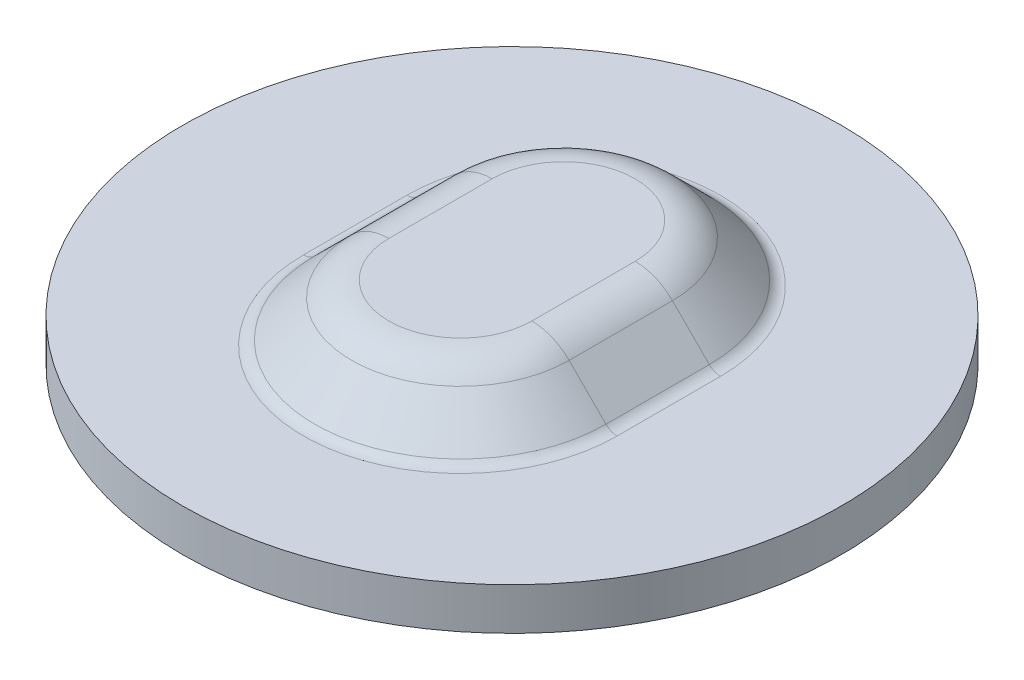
ISO-10303-21;
HEADER;
FILE_DESCRIPTION(('STEP AP214'),'2;1');
FILE_NAME('part.step','',(''),(''),'','','');
FILE_SCHEMA(('AUTOMOTIVE_DESIGN { 1 0 10303 214 1 1 1 1 }'));
ENDSEC;
DATA;
#1=APPLICATION_CONTEXT('core data for automotive mechanical design processes');
#2=APPLICATION_PROTOCOL_DEFINITION('international standard','automotive_design',2000,#1);
#3=PRODUCT_CONTEXT('',#1,'mechanical');
#4=PRODUCT('Part','Part','',(#3));
#5=PRODUCT_RELATED_PRODUCT_CATEGORY('part','',(#4));
#6=PRODUCT_DEFINITION_FORMATION('','',#4);
#7=PRODUCT_DEFINITION_CONTEXT('part definition',#1,'design');
#8=PRODUCT_DEFINITION('design','',#6,#7);
#9=PRODUCT_DEFINITION_SHAPE('','',#8);
#10=(LENGTH_UNIT() NAMED_UNIT(*) SI_UNIT(.MILLI.,.METRE.));
#11=(NAMED_UNIT(*) PLANE_ANGLE_UNIT() SI_UNIT($,.RADIAN.));
#12=(NAMED_UNIT(*) SI_UNIT($,.STERADIAN.) SOLID_ANGLE_UNIT());
#13=UNCERTAINTY_MEASURE_WITH_UNIT(LENGTH_MEASURE(1.E-05),#10,'distance_accuracy_value','');
#14=(GEOMETRIC_REPRESENTATION_CONTEXT(3) GLOBAL_UNCERTAINTY_ASSIGNED_CONTEXT((#13)) GLOBAL_UNIT_ASSIGNED_CONTEXT((#10,
#11,#12)) REPRESENTATION_CONTEXT('',''));
#15=CARTESIAN_POINT('',(0.,0.,0.));
#16=DIRECTION('',(0.,0.,1.));
#17=DIRECTION('',(1.,0.,0.));
#18=AXIS2_PLACEMENT_3D('',#15,#16,#17);
#19=CARTESIAN_POINT('',(0.472109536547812,0.,-1.65075517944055));
#20=DIRECTION('',(0.,-1.,0.));
#21=DIRECTION('',(0.,0.,-1.));
#22=AXIS2_PLACEMENT_3D('',#19,#20,#21);
#23=PLANE('',#22);
#24=DIRECTION('',(0.,0.,1.));
#25=VECTOR('',#24,1.);
#26=CARTESIAN_POINT('',(3.91580708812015,0.,-1.65075517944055));
#27=LINE('',#26,#25);
#28=CARTESIAN_POINT('',(3.91580708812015,0.,-1.65075517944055));
#29=VERTEX_POINT('',#28);
#30=CARTESIAN_POINT('',(3.91580708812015,0.,3.32764482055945));
#31=VERTEX_POINT('',#30);
#32=EDGE_CURVE('E156',#29,#31,#27,.T.);
#33=ORIENTED_EDGE('',*,*,#32,.F.);
#34=CARTESIAN_POINT('',(0.472109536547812,0.,-1.65075517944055));
#35=DIRECTION('',(0.,-1.,0.));
#36=DIRECTION('',(0.,0.,-1.));
#37=AXIS2_PLACEMENT_3D('',#34,#35,#36);
#38=CIRCLE('',#37,3.44369755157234);
#39=CARTESIAN_POINT('',(0.472109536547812,0.,-5.09445273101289));
#40=VERTEX_POINT('',#39);
#41=EDGE_CURVE('E143',#40,#29,#38,.T.);
#42=ORIENTED_EDGE('',*,*,#41,.F.);
#43=CARTESIAN_POINT('',(0.472109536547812,0.,-1.65075517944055));
#44=DIRECTION('',(0.,-1.,0.));
#45=DIRECTION('',(-1.,0.,0.));
#46=AXIS2_PLACEMENT_3D('',#43,#44,#45);
#47=CIRCLE('',#46,3.44369755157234);
#48=CARTESIAN_POINT('',(-2.97158801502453,0.,-1.65075517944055));
#49=VERTEX_POINT('',#48);
#50=EDGE_CURVE('E150',#49,#40,#47,.T.);
#51=ORIENTED_EDGE('',*,*,#50,.F.);
#52=DIRECTION('',(0.,0.,-1.));
#53=VECTOR('',#52,1.);
#54=CARTESIAN_POINT('',(-2.97158801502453,0.,-1.65075517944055));
#55=LINE('',#54,#53);
#56=CARTESIAN_POINT('',(-2.97158801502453,0.,3.32764482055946));
#57=VERTEX_POINT('',#56);
#58=EDGE_CURVE('E205',#57,#49,#55,.T.);
#59=ORIENTED_EDGE('',*,*,#58,.F.);
#60=CARTESIAN_POINT('',(0.472109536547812,0.,3.32764482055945));
#61=DIRECTION('',(0.,-1.,0.));
#62=DIRECTION('',(1.,0.,0.));
#63=AXIS2_PLACEMENT_3D('',#60,#61,#62);
#64=CIRCLE('',#63,3.44369755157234);
#65=EDGE_CURVE('E158',#31,#57,#64,.T.);
#66=ORIENTED_EDGE('',*,*,#65,.F.);
#67=EDGE_LOOP('',(#33,#42,#51,#59,#66));
#68=FACE_BOUND('',#67,.T.);
#69=ADVANCED_FACE('F18',(#68),#23,.F.);
#70=CARTESIAN_POINT('',(0.472109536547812,-2.54,-1.65075517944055));
#71=DIRECTION('',(0.,-1.,0.));
#72=DIRECTION('',(0.,0.,-1.));
#73=AXIS2_PLACEMENT_3D('',#70,#71,#72);
#74=TOROIDAL_SURFACE('',#73,3.44369755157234,2.54);
#75=CARTESIAN_POINT('',(0.472109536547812,-0.743948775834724,-1.65075517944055));
#76=DIRECTION('',(0.,-1.,0.));
#77=DIRECTION('',(0.,0.,-1.));
#78=AXIS2_PLACEMENT_3D('',#75,#76,#77);
#79=CIRCLE('',#78,5.23974877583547);
#80=CARTESIAN_POINT('',(-4.76763923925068,-0.743948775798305,-1.65075517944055));
#81=VERTEX_POINT('',#80);
#82=CARTESIAN_POINT('',(5.71185831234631,-0.743948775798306,-1.65075517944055));
#83=VERTEX_POINT('',#82);
#84=EDGE_CURVE('E163',#81,#83,#79,.T.);
#85=ORIENTED_EDGE('',*,*,#84,.F.);
#86=CARTESIAN_POINT('',(-2.97158801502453,-2.54,-1.65075517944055));
#87=DIRECTION('',(0.,0.,-1.));
#88=DIRECTION('',(-1.,0.,0.));
#89=AXIS2_PLACEMENT_3D('',#86,#87,#88);
#90=CIRCLE('',#89,2.54);
#91=EDGE_CURVE('E214',#49,#81,#90,.F.);
#92=ORIENTED_EDGE('',*,*,#91,.F.);
#93=ORIENTED_EDGE('',*,*,#50,.T.);
#94=ORIENTED_EDGE('',*,*,#41,.T.);
#95=CARTESIAN_POINT('',(3.91580708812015,-2.54,-1.65075517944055));
#96=DIRECTION('',(0.,0.,1.));
#97=DIRECTION('',(1.,0.,0.));
#98=AXIS2_PLACEMENT_3D('',#95,#96,#97);
#99=CIRCLE('',#98,2.54);
#100=EDGE_CURVE('E147',#83,#29,#99,.T.);
#101=ORIENTED_EDGE('',*,*,#100,.F.);
#102=EDGE_LOOP('',(#85,#92,#93,#94,#101));
#103=FACE_BOUND('',#102,.T.);
#104=ADVANCED_FACE('F145',(#103),#74,.T.);
#105=CARTESIAN_POINT('',(-2.97158801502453,-2.54,-1.65075517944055));
#106=DIRECTION('',(0.,0.,-1.));
#107=DIRECTION('',(-1.,0.,0.));
#108=AXIS2_PLACEMENT_3D('',#105,#106,#107);
#109=CYLINDRICAL_SURFACE('',#108,2.54);
#110=CARTESIAN_POINT('',(-2.97158801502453,-2.54,3.32764482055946));
#111=DIRECTION('',(0.,0.,-1.));
#112=DIRECTION('',(-1.,0.,0.));
#113=AXIS2_PLACEMENT_3D('',#110,#111,#112);
#114=CIRCLE('',#113,2.54);
#115=CARTESIAN_POINT('',(-4.7676392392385,-0.743948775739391,3.32764482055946));
#116=VERTEX_POINT('',#115);
#117=EDGE_CURVE('E213',#57,#116,#114,.F.);
#118=ORIENTED_EDGE('',*,*,#117,.F.);
#119=ORIENTED_EDGE('',*,*,#58,.T.);
#120=ORIENTED_EDGE('',*,*,#91,.T.);
#121=DIRECTION('',(0.,0.,1.));
#122=VECTOR('',#121,1.);
#123=CARTESIAN_POINT('',(-4.76763923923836,-0.743948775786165,3.32764482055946));
#124=LINE('',#123,#122);
#125=EDGE_CURVE('E188',#116,#81,#124,.F.);
#126=ORIENTED_EDGE('',*,*,#125,.F.);
#127=EDGE_LOOP('',(#118,#119,#120,#126));
#128=FACE_BOUND('',#127,.T.);
#129=ADVANCED_FACE('F196',(#128),#109,.T.);
#130=CARTESIAN_POINT('',(0.472109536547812,-2.54,3.32764482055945));
#131=DIRECTION('',(0.,-1.,0.));
#132=DIRECTION('',(0.,0.,-1.));
#133=AXIS2_PLACEMENT_3D('',#130,#131,#132);
#134=TOROIDAL_SURFACE('',#133,3.44369755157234,2.54);
#135=CARTESIAN_POINT('',(3.91580708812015,-2.54,3.32764482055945));
#136=DIRECTION('',(0.,0.,1.));
#137=DIRECTION('',(1.,0.,0.));
#138=AXIS2_PLACEMENT_3D('',#135,#136,#137);
#139=CIRCLE('',#138,2.54);
#140=CARTESIAN_POINT('',(5.71185831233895,-0.743948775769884,3.32764482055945));
#141=VERTEX_POINT('',#140);
#142=EDGE_CURVE('E169',#31,#141,#139,.F.);
#143=ORIENTED_EDGE('',*,*,#142,.F.);
#144=ORIENTED_EDGE('',*,*,#65,.T.);
#145=ORIENTED_EDGE('',*,*,#117,.T.);
#146=CARTESIAN_POINT('',(0.472109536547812,-0.743948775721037,3.32764482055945));
#147=DIRECTION('',(0.,-1.,0.));
#148=DIRECTION('',(0.,0.,1.));
#149=AXIS2_PLACEMENT_3D('',#146,#147,#148);
#150=CIRCLE('',#149,5.23974877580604);
#151=EDGE_CURVE('E178',#141,#116,#150,.T.);
#152=ORIENTED_EDGE('',*,*,#151,.F.);
#153=EDGE_LOOP('',(#143,#144,#145,#152));
#154=FACE_BOUND('',#153,.T.);
#155=ADVANCED_FACE('F191',(#154),#134,.T.);
#156=CARTESIAN_POINT('',(3.91580708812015,-2.54,-1.65075517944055));
#157=DIRECTION('',(0.,0.,1.));
#158=DIRECTION('',(1.,0.,0.));
#159=AXIS2_PLACEMENT_3D('',#156,#157,#158);
#160=CYLINDRICAL_SURFACE('',#159,2.54);
#161=ORIENTED_EDGE('',*,*,#100,.T.);
#162=ORIENTED_EDGE('',*,*,#32,.T.);
#163=ORIENTED_EDGE('',*,*,#142,.T.);
#164=DIRECTION('',(0.,0.,1.));
#165=VECTOR('',#164,1.);
#166=CARTESIAN_POINT('',(5.71185831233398,-0.743948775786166,3.32764482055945));
#167=LINE('',#166,#165);
#168=EDGE_CURVE('E167',#83,#141,#167,.T.);
#169=ORIENTED_EDGE('',*,*,#168,.F.);
#170=EDGE_LOOP('',(#161,#162,#163,#169));
#171=FACE_BOUND('',#170,.T.);
#172=ADVANCED_FACE('F165',(#171),#160,.T.);
#173=CARTESIAN_POINT('',(0.472109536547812,-2.032,-1.65075517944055));
#174=DIRECTION('',(0.,-1.,0.));
#175=DIRECTION('',(0.,0.,-1.));
#176=AXIS2_PLACEMENT_3D('',#173,#174,#175);
#177=PLANE('',#176);
#178=CARTESIAN_POINT('',(0.472109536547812,-2.032,-1.65075517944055));
#179=DIRECTION('',(0.,1.,0.));
#180=DIRECTION('',(1.,0.,0.));
#181=AXIS2_PLACEMENT_3D('',#178,#179,#180);
#182=CIRCLE('',#181,3.44369755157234);
#183=CARTESIAN_POINT('',(0.472109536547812,-2.032,-5.09445273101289));
#184=VERTEX_POINT('',#183);
#185=CARTESIAN_POINT('',(3.91580708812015,-2.032,-1.65075517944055));
#186=VERTEX_POINT('',#185);
#187=EDGE_CURVE('E312',#184,#186,#182,.F.);
#188=ORIENTED_EDGE('',*,*,#187,.T.);
#189=DIRECTION('',(0.,0.,1.));
#190=VECTOR('',#189,1.);
#191=CARTESIAN_POINT('',(3.91580708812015,-2.032,-1.65075517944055));
#192=LINE('',#191,#190);
#193=CARTESIAN_POINT('',(3.91580708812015,-2.032,3.32764482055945));
#194=VERTEX_POINT('',#193);
#195=EDGE_CURVE('E277',#186,#194,#192,.T.);
#196=ORIENTED_EDGE('',*,*,#195,.T.);
#197=CARTESIAN_POINT('',(0.472109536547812,-2.032,3.32764482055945));
#198=DIRECTION('',(0.,1.,0.));
#199=DIRECTION('',(-1.,0.,0.));
#200=AXIS2_PLACEMENT_3D('',#197,#198,#199);
#201=CIRCLE('',#200,3.44369755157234);
#202=CARTESIAN_POINT('',(-2.97158801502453,-2.032,3.32764482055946));
#203=VERTEX_POINT('',#202);
#204=EDGE_CURVE('E360',#194,#203,#201,.F.);
#205=ORIENTED_EDGE('',*,*,#204,.T.);
#206=DIRECTION('',(0.,0.,-1.));
#207=VECTOR('',#206,1.);
#208=CARTESIAN_POINT('',(-2.97158801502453,-2.032,-1.65075517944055));
#209=LINE('',#208,#207);
#210=CARTESIAN_POINT('',(-2.97158801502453,-2.032,-1.65075517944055));
#211=VERTEX_POINT('',#210);
#212=EDGE_CURVE('E351',#203,#211,#209,.T.);
#213=ORIENTED_EDGE('',*,*,#212,.T.);
#214=CARTESIAN_POINT('',(0.472109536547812,-2.032,-1.65075517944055));
#215=DIRECTION('',(0.,1.,0.));
#216=DIRECTION('',(0.,0.,-1.));
#217=AXIS2_PLACEMENT_3D('',#214,#215,#216);
#218=CIRCLE('',#217,3.44369755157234);
#219=EDGE_CURVE('E354',#211,#184,#218,.F.);
#220=ORIENTED_EDGE('',*,*,#219,.T.);
#221=EDGE_LOOP('',(#188,#196,#205,#213,#220));
#222=FACE_BOUND('',#221,.T.);
#223=ADVANCED_FACE('F366',(#222),#177,.T.);
#224=CARTESIAN_POINT('',(0.472109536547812,-2.52001536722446,-1.65075517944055));
#225=DIRECTION('',(0.,-1.,0.));
#226=DIRECTION('',(0.,0.,-1.));
#227=AXIS2_PLACEMENT_3D('',#224,#225,#226);
#228=CONICAL_SURFACE('',#227,7.01581536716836,0.785398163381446);
#229=CARTESIAN_POINT('',(0.472109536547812,-2.52001536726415,-1.65075517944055));
#230=DIRECTION('',(0.,-1.,0.));
#231=DIRECTION('',(0.,0.,-1.));
#232=AXIS2_PLACEMENT_3D('',#229,#230,#231);
#233=CIRCLE('',#232,7.01581536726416);
#234=CARTESIAN_POINT('',(7.48792490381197,-2.52001536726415,-1.65075517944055));
#235=VERTEX_POINT('',#234);
#236=CARTESIAN_POINT('',(-6.54370583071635,-2.52001536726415,-1.65075517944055));
#237=VERTEX_POINT('',#236);
#238=EDGE_CURVE('E335',#235,#237,#233,.F.);
#239=ORIENTED_EDGE('',*,*,#238,.T.);
#240=DIRECTION('',(-0.707106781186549,-0.707106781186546,0.));
#241=VECTOR('',#240,1.);
#242=CARTESIAN_POINT('',(-4.02369046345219,0.,-1.65075517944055));
#243=LINE('',#242,#241);
#244=EDGE_CURVE('E346',#81,#237,#243,.T.);
#245=ORIENTED_EDGE('',*,*,#244,.F.);
#246=ORIENTED_EDGE('',*,*,#84,.T.);
#247=DIRECTION('',(-0.707106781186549,0.707106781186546,0.));
#248=VECTOR('',#247,1.);
#249=CARTESIAN_POINT('',(4.96790953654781,0.,-1.65075517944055));
#250=LINE('',#249,#248);
#251=EDGE_CURVE('E276',#235,#83,#250,.T.);
#252=ORIENTED_EDGE('',*,*,#251,.F.);
#253=EDGE_LOOP('',(#239,#245,#246,#252));
#254=FACE_BOUND('',#253,.T.);
#255=ADVANCED_FACE('F375',(#254),#228,.T.);
#256=CARTESIAN_POINT('',(-4.02369046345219,0.,3.32764482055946));
#257=DIRECTION('',(-0.707106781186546,0.707106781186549,0.));
#258=DIRECTION('',(-0.707106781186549,-0.707106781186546,0.));
#259=AXIS2_PLACEMENT_3D('',#256,#257,#258);
#260=PLANE('',#259);
#261=DIRECTION('',(0.707106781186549,0.707106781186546,0.));
#262=VECTOR('',#261,1.);
#263=CARTESIAN_POINT('',(-498996.200245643,-498992.176555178,3.32764482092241));
#264=LINE('',#263,#262);
#265=CARTESIAN_POINT('',(-6.54370583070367,-2.52001536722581,3.32764482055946));
#266=VERTEX_POINT('',#265);
#267=EDGE_CURVE('E181',#116,#266,#264,.F.);
#268=ORIENTED_EDGE('',*,*,#267,.F.);
#269=ORIENTED_EDGE('',*,*,#125,.T.);
#270=ORIENTED_EDGE('',*,*,#244,.T.);
#271=DIRECTION('',(0.,0.,1.));
#272=VECTOR('',#271,1.);
#273=CARTESIAN_POINT('',(-6.54370583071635,-2.52001536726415,3.32764482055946));
#274=LINE('',#273,#272);
#275=EDGE_CURVE('E332',#237,#266,#274,.T.);
#276=ORIENTED_EDGE('',*,*,#275,.T.);
#277=EDGE_LOOP('',(#268,#269,#270,#276));
#278=FACE_BOUND('',#277,.T.);
#279=ADVANCED_FACE('F876',(#278),#260,.T.);
#280=CARTESIAN_POINT('',(0.472109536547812,-2.52001536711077,3.32764482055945));
#281=DIRECTION('',(0.,-1.,0.));
#282=DIRECTION('',(0.,0.,-1.));
#283=AXIS2_PLACEMENT_3D('',#280,#281,#282);
#284=CONICAL_SURFACE('',#283,7.01581536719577,0.785398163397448);
#285=CARTESIAN_POINT('',(0.472109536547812,-2.52001536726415,3.32764482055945));
#286=DIRECTION('',(0.,-1.,0.));
#287=DIRECTION('',(0.,0.,-1.));
#288=AXIS2_PLACEMENT_3D('',#285,#286,#287);
#289=CIRCLE('',#288,7.01581536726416);
#290=CARTESIAN_POINT('',(7.48792490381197,-2.52001536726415,3.32764482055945));
#291=VERTEX_POINT('',#290);
#292=EDGE_CURVE('E326',#266,#291,#289,.F.);
#293=ORIENTED_EDGE('',*,*,#292,.T.);
#294=DIRECTION('',(-0.707106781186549,0.707106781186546,0.));
#295=VECTOR('',#294,1.);
#296=CARTESIAN_POINT('',(4.96790953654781,0.,3.32764482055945));
#297=LINE('',#296,#295);
#298=EDGE_CURVE('E180',#141,#291,#297,.F.);
#299=ORIENTED_EDGE('',*,*,#298,.F.);
#300=ORIENTED_EDGE('',*,*,#151,.T.);
#301=ORIENTED_EDGE('',*,*,#267,.T.);
#302=EDGE_LOOP('',(#293,#299,#300,#301));
#303=FACE_BOUND('',#302,.T.);
#304=ADVANCED_FACE('F869',(#303),#284,.T.);
#305=CARTESIAN_POINT('',(4.96790953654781,0.,3.32764482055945));
#306=DIRECTION('',(0.707106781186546,0.707106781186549,0.));
#307=DIRECTION('',(-0.707106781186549,0.707106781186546,0.));
#308=AXIS2_PLACEMENT_3D('',#305,#306,#307);
#309=PLANE('',#308);
#310=ORIENTED_EDGE('',*,*,#251,.T.);
#311=ORIENTED_EDGE('',*,*,#168,.T.);
#312=ORIENTED_EDGE('',*,*,#298,.T.);
#313=DIRECTION('',(0.,0.,-1.));
#314=VECTOR('',#313,1.);
#315=CARTESIAN_POINT('',(7.48792490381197,-2.52001536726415,3.32764482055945));
#316=LINE('',#315,#314);
#317=EDGE_CURVE('E315',#291,#235,#316,.T.);
#318=ORIENTED_EDGE('',*,*,#317,.T.);
#319=EDGE_LOOP('',(#310,#311,#312,#318));
#320=FACE_BOUND('',#319,.T.);
#321=ADVANCED_FACE('F272',(#320),#309,.T.);
#322=CARTESIAN_POINT('',(3.91580708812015,-2.54,-1.65075517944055));
#323=DIRECTION('',(0.,0.,1.));
#324=DIRECTION('',(1.,0.,0.));
#325=AXIS2_PLACEMENT_3D('',#322,#323,#324);
#326=CYLINDRICAL_SURFACE('',#325,0.508000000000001);
#327=ORIENTED_EDGE('',*,*,#195,.F.);
#328=CARTESIAN_POINT('',(3.91580708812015,-2.54,-1.65075517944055));
#329=DIRECTION('',(0.,0.,1.));
#330=DIRECTION('',(1.,0.,0.));
#331=AXIS2_PLACEMENT_3D('',#328,#329,#330);
#332=CIRCLE('',#331,0.508);
#333=CARTESIAN_POINT('',(4.27501733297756,-2.18078975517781,-1.65075517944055));
#334=VERTEX_POINT('',#333);
#335=EDGE_CURVE('E278',#186,#334,#332,.F.);
#336=ORIENTED_EDGE('',*,*,#335,.T.);
#337=DIRECTION('',(0.,0.,1.));
#338=VECTOR('',#337,1.);
#339=CARTESIAN_POINT('',(4.27501733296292,-2.18078975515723,3.32764482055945));
#340=LINE('',#339,#338);
#341=CARTESIAN_POINT('',(4.27501733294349,-2.18078975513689,3.32764482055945));
#342=VERTEX_POINT('',#341);
#343=EDGE_CURVE('E429',#334,#342,#340,.T.);
#344=ORIENTED_EDGE('',*,*,#343,.T.);
#345=CARTESIAN_POINT('',(3.91580708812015,-2.54,3.32764482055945));
#346=DIRECTION('',(0.,0.,1.));
#347=DIRECTION('',(1.,0.,0.));
#348=AXIS2_PLACEMENT_3D('',#345,#346,#347);
#349=CIRCLE('',#348,0.508);
#350=EDGE_CURVE('E424',#342,#194,#349,.T.);
#351=ORIENTED_EDGE('',*,*,#350,.T.);
#352=EDGE_LOOP('',(#327,#336,#344,#351));
#353=FACE_BOUND('',#352,.T.);
#354=ADVANCED_FACE('F300',(#353),#326,.F.);
#355=CARTESIAN_POINT('',(0.472109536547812,-2.54,-1.65075517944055));
#356=DIRECTION('',(0.,-1.,0.));
#357=DIRECTION('',(0.,0.,-1.));
#358=AXIS2_PLACEMENT_3D('',#355,#356,#357);
#359=TOROIDAL_SURFACE('',#358,3.44369755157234,0.508);
#360=ORIENTED_EDGE('',*,*,#219,.F.);
#361=CARTESIAN_POINT('',(-2.97158801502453,-2.54,-1.65075517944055));
#362=DIRECTION('',(0.,0.,-1.));
#363=DIRECTION('',(-1.,0.,0.));
#364=AXIS2_PLACEMENT_3D('',#361,#362,#363);
#365=CIRCLE('',#364,0.508);
#366=CARTESIAN_POINT('',(-3.33079825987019,-2.18078975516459,-1.65075517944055));
#367=VERTEX_POINT('',#366);
#368=EDGE_CURVE('E353',#211,#367,#365,.F.);
#369=ORIENTED_EDGE('',*,*,#368,.T.);
#370=CARTESIAN_POINT('',(0.472109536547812,-2.18078975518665,-1.65075517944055));
#371=DIRECTION('',(0.,-1.,0.));
#372=DIRECTION('',(0.,0.,-1.));
#373=AXIS2_PLACEMENT_3D('',#370,#371,#372);
#374=CIRCLE('',#373,3.8029077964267);
#375=EDGE_CURVE('E442',#367,#334,#374,.T.);
#376=ORIENTED_EDGE('',*,*,#375,.T.);
#377=ORIENTED_EDGE('',*,*,#335,.F.);
#378=ORIENTED_EDGE('',*,*,#187,.F.);
#379=EDGE_LOOP('',(#360,#369,#376,#377,#378));
#380=FACE_BOUND('',#379,.T.);
#381=ADVANCED_FACE('F288',(#380),#359,.F.);
#382=CARTESIAN_POINT('',(-2.97158801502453,-2.54,-1.65075517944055));
#383=DIRECTION('',(0.,0.,-1.));
#384=DIRECTION('',(-1.,0.,0.));
#385=AXIS2_PLACEMENT_3D('',#382,#383,#384);
#386=CYLINDRICAL_SURFACE('',#385,0.508);
#387=ORIENTED_EDGE('',*,*,#212,.F.);
#388=CARTESIAN_POINT('',(-2.97158801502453,-2.54,3.32764482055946));
#389=DIRECTION('',(0.,0.,-1.));
#390=DIRECTION('',(-1.,0.,0.));
#391=AXIS2_PLACEMENT_3D('',#388,#389,#390);
#392=CIRCLE('',#391,0.508);
#393=CARTESIAN_POINT('',(-3.33079825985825,-2.18078975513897,3.32764482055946));
#394=VERTEX_POINT('',#393);
#395=EDGE_CURVE('E343',#203,#394,#392,.F.);
#396=ORIENTED_EDGE('',*,*,#395,.T.);
#397=DIRECTION('',(0.,0.,1.));
#398=VECTOR('',#397,1.);
#399=CARTESIAN_POINT('',(-3.33079825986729,-2.18078975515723,3.32764482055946));
#400=LINE('',#399,#398);
#401=EDGE_CURVE('E438',#394,#367,#400,.F.);
#402=ORIENTED_EDGE('',*,*,#401,.T.);
#403=ORIENTED_EDGE('',*,*,#368,.F.);
#404=EDGE_LOOP('',(#387,#396,#402,#403));
#405=FACE_BOUND('',#404,.T.);
#406=ADVANCED_FACE('F299',(#405),#386,.F.);
#407=CARTESIAN_POINT('',(0.472109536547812,-2.54,3.32764482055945));
#408=DIRECTION('',(0.,-1.,0.));
#409=DIRECTION('',(0.,0.,-1.));
#410=AXIS2_PLACEMENT_3D('',#407,#408,#409);
#411=TOROIDAL_SURFACE('',#410,3.44369755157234,0.508);
#412=ORIENTED_EDGE('',*,*,#204,.F.);
#413=ORIENTED_EDGE('',*,*,#350,.F.);
#414=CARTESIAN_POINT('',(0.472109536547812,-2.18078975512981,3.32764482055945));
#415=DIRECTION('',(0.,-1.,0.));
#416=DIRECTION('',(0.,0.,1.));
#417=AXIS2_PLACEMENT_3D('',#414,#415,#416);
#418=CIRCLE('',#417,3.80290779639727);
#419=EDGE_CURVE('E526',#342,#394,#418,.T.);
#420=ORIENTED_EDGE('',*,*,#419,.T.);
#421=ORIENTED_EDGE('',*,*,#395,.F.);
#422=EDGE_LOOP('',(#412,#413,#420,#421));
#423=FACE_BOUND('',#422,.T.);
#424=ADVANCED_FACE('F405',(#423),#411,.F.);
#425=CARTESIAN_POINT('',(0.472109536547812,-1.9812,-1.65075517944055));
#426=DIRECTION('',(0.,-1.,0.));
#427=DIRECTION('',(0.,0.,-1.));
#428=AXIS2_PLACEMENT_3D('',#425,#426,#427);
#429=TOROIDAL_SURFACE('',#428,7.55463073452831,0.762);
#430=CARTESIAN_POINT('',(0.472109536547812,-2.7432,-1.65075517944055));
#431=DIRECTION('',(0.,1.,0.));
#432=DIRECTION('',(0.,0.,-1.));
#433=AXIS2_PLACEMENT_3D('',#430,#431,#432);
#434=CIRCLE('',#433,7.55463073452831);
#435=CARTESIAN_POINT('',(0.472109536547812,-2.7432,-9.20538591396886));
#436=VERTEX_POINT('',#435);
#437=CARTESIAN_POINT('',(-7.08252119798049,-2.7432,-1.65075517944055));
#438=VERTEX_POINT('',#437);
#439=EDGE_CURVE('E522',#436,#438,#434,.T.);
#440=ORIENTED_EDGE('',*,*,#439,.T.);
#441=CARTESIAN_POINT('',(-7.08252119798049,-1.9812,-1.65075517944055));
#442=DIRECTION('',(0.,0.,1.));
#443=DIRECTION('',(1.,0.,0.));
#444=AXIS2_PLACEMENT_3D('',#441,#442,#443);
#445=CIRCLE('',#444,0.762);
#446=EDGE_CURVE('E329',#438,#237,#445,.T.);
#447=ORIENTED_EDGE('',*,*,#446,.T.);
#448=ORIENTED_EDGE('',*,*,#238,.F.);
#449=CARTESIAN_POINT('',(8.02674027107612,-1.9812,-1.65075517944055));
#450=DIRECTION('',(0.,0.,-1.));
#451=DIRECTION('',(-1.,0.,0.));
#452=AXIS2_PLACEMENT_3D('',#449,#450,#451);
#453=CIRCLE('',#452,0.762);
#454=CARTESIAN_POINT('',(8.02674027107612,-2.7432,-1.65075517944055));
#455=VERTEX_POINT('',#454);
#456=EDGE_CURVE('E317',#235,#455,#453,.F.);
#457=ORIENTED_EDGE('',*,*,#456,.T.);
#458=CARTESIAN_POINT('',(0.472109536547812,-2.7432,-1.65075517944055));
#459=DIRECTION('',(0.,1.,0.));
#460=DIRECTION('',(1.,0.,0.));
#461=AXIS2_PLACEMENT_3D('',#458,#459,#460);
#462=CIRCLE('',#461,7.55463073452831);
#463=EDGE_CURVE('E532',#455,#436,#462,.T.);
#464=ORIENTED_EDGE('',*,*,#463,.T.);
#465=EDGE_LOOP('',(#440,#447,#448,#457,#464));
#466=FACE_BOUND('',#465,.T.);
#467=ADVANCED_FACE('F415',(#466),#429,.F.);
#468=CARTESIAN_POINT('',(-7.08252119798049,-1.9812,3.32764482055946));
#469=DIRECTION('',(0.,0.,1.));
#470=DIRECTION('',(1.,0.,0.));
#471=AXIS2_PLACEMENT_3D('',#468,#469,#470);
#472=CYLINDRICAL_SURFACE('',#471,0.762);
#473=DIRECTION('',(0.,0.,-1.));
#474=VECTOR('',#473,1.);
#475=CARTESIAN_POINT('',(-7.08252119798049,-2.7432,0.838444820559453));
#476=LINE('',#475,#474);
#477=CARTESIAN_POINT('',(-7.08252119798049,-2.7432,3.32764482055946));
#478=VERTEX_POINT('',#477);
#479=EDGE_CURVE('E664',#438,#478,#476,.F.);
#480=ORIENTED_EDGE('',*,*,#479,.T.);
#481=CARTESIAN_POINT('',(-7.08252119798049,-1.9812,3.32764482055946));
#482=DIRECTION('',(0.,0.,-1.));
#483=DIRECTION('',(-1.,0.,0.));
#484=AXIS2_PLACEMENT_3D('',#481,#482,#483);
#485=CIRCLE('',#484,0.762);
#486=EDGE_CURVE('E328',#478,#266,#485,.F.);
#487=ORIENTED_EDGE('',*,*,#486,.T.);
#488=ORIENTED_EDGE('',*,*,#275,.F.);
#489=ORIENTED_EDGE('',*,*,#446,.F.);
#490=EDGE_LOOP('',(#480,#487,#488,#489));
#491=FACE_BOUND('',#490,.T.);
#492=ADVANCED_FACE('F499',(#491),#472,.F.);
#493=CARTESIAN_POINT('',(0.472109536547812,-1.9812,3.32764482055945));
#494=DIRECTION('',(0.,-1.,0.));
#495=DIRECTION('',(0.,0.,-1.));
#496=AXIS2_PLACEMENT_3D('',#493,#494,#495);
#497=TOROIDAL_SURFACE('',#496,7.55463073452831,0.762);
#498=CARTESIAN_POINT('',(0.472109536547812,-2.7432,3.32764482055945));
#499=DIRECTION('',(0.,1.,0.));
#500=DIRECTION('',(-1.,0.,0.));
#501=AXIS2_PLACEMENT_3D('',#498,#499,#500);
#502=CIRCLE('',#501,7.55463073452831);
#503=CARTESIAN_POINT('',(8.02674027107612,-2.7432,3.32764482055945));
#504=VERTEX_POINT('',#503);
#505=EDGE_CURVE('E651',#478,#504,#502,.T.);
#506=ORIENTED_EDGE('',*,*,#505,.T.);
#507=CARTESIAN_POINT('',(8.02674027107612,-1.9812,3.32764482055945));
#508=DIRECTION('',(0.,0.,-1.));
#509=DIRECTION('',(-1.,0.,0.));
#510=AXIS2_PLACEMENT_3D('',#507,#508,#509);
#511=CIRCLE('',#510,0.762);
#512=EDGE_CURVE('E318',#504,#291,#511,.T.);
#513=ORIENTED_EDGE('',*,*,#512,.T.);
#514=ORIENTED_EDGE('',*,*,#292,.F.);
#515=ORIENTED_EDGE('',*,*,#486,.F.);
#516=EDGE_LOOP('',(#506,#513,#514,#515));
#517=FACE_BOUND('',#516,.T.);
#518=ADVANCED_FACE('F494',(#517),#497,.F.);
#519=CARTESIAN_POINT('',(8.02674027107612,-1.9812,3.32764482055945));
#520=DIRECTION('',(0.,0.,-1.));
#521=DIRECTION('',(-1.,0.,0.));
#522=AXIS2_PLACEMENT_3D('',#519,#520,#521);
#523=CYLINDRICAL_SURFACE('',#522,0.762);
#524=ORIENTED_EDGE('',*,*,#317,.F.);
#525=ORIENTED_EDGE('',*,*,#512,.F.);
#526=DIRECTION('',(0.,0.,-1.));
#527=VECTOR('',#526,1.);
#528=CARTESIAN_POINT('',(8.02674027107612,-2.7432,0.838444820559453));
#529=LINE('',#528,#527);
#530=EDGE_CURVE('E611',#504,#455,#529,.T.);
#531=ORIENTED_EDGE('',*,*,#530,.T.);
#532=ORIENTED_EDGE('',*,*,#456,.F.);
#533=EDGE_LOOP('',(#524,#525,#531,#532));
#534=FACE_BOUND('',#533,.T.);
#535=ADVANCED_FACE('F498',(#534),#523,.F.);
#536=CARTESIAN_POINT('',(3.53106855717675,-1.43684097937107,3.32764482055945));
#537=DIRECTION('',(0.707106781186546,0.707106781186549,0.));
#538=DIRECTION('',(-0.707106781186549,0.707106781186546,0.));
#539=AXIS2_PLACEMENT_3D('',#536,#537,#538);
#540=PLANE('',#539);
#541=ORIENTED_EDGE('',*,*,#343,.F.);
#542=DIRECTION('',(-0.707106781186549,0.707106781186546,0.));
#543=VECTOR('',#542,1.);
#544=CARTESIAN_POINT('',(498998.821354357,-498996.727126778,-1.6507551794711));
#545=LINE('',#544,#543);
#546=CARTESIAN_POINT('',(6.05108392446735,-3.95685634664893,-1.65075517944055));
#547=VERTEX_POINT('',#546);
#548=EDGE_CURVE('E431',#334,#547,#545,.F.);
#549=ORIENTED_EDGE('',*,*,#548,.T.);
#550=DIRECTION('',(0.,0.,-1.));
#551=VECTOR('',#550,1.);
#552=CARTESIAN_POINT('',(6.05108392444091,-3.95685634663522,3.32764482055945));
#553=LINE('',#552,#551);
#554=CARTESIAN_POINT('',(6.05108392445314,-3.95685634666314,3.32764482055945));
#555=VERTEX_POINT('',#554);
#556=EDGE_CURVE('E603',#555,#547,#553,.T.);
#557=ORIENTED_EDGE('',*,*,#556,.F.);
#558=DIRECTION('',(-0.707106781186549,0.707106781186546,0.));
#559=VECTOR('',#558,1.);
#560=CARTESIAN_POINT('',(498997.144464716,-498995.050237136,3.32764482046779));
#561=LINE('',#560,#559);
#562=EDGE_CURVE('E466',#555,#342,#561,.T.);
#563=ORIENTED_EDGE('',*,*,#562,.T.);
#564=EDGE_LOOP('',(#541,#549,#557,#563));
#565=FACE_BOUND('',#564,.T.);
#566=ADVANCED_FACE('F601',(#565),#540,.F.);
#567=CARTESIAN_POINT('',(0.472109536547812,-3.95685634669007,-1.65075517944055));
#568=DIRECTION('',(0.,-1.,0.));
#569=DIRECTION('',(0.,0.,-1.));
#570=AXIS2_PLACEMENT_3D('',#567,#568,#569);
#571=CONICAL_SURFACE('',#570,5.57897438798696,0.785398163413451);
#572=ORIENTED_EDGE('',*,*,#375,.F.);
#573=DIRECTION('',(-0.707106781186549,-0.707106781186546,0.));
#574=VECTOR('',#573,1.);
#575=CARTESIAN_POINT('',(-2.58684948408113,-1.43684097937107,-1.65075517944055));
#576=LINE('',#575,#574);
#577=CARTESIAN_POINT('',(-5.10686485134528,-3.95685634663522,-1.65075517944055));
#578=VERTEX_POINT('',#577);
#579=EDGE_CURVE('E441',#367,#578,#576,.T.);
#580=ORIENTED_EDGE('',*,*,#579,.T.);
#581=CARTESIAN_POINT('',(0.472109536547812,-3.95685634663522,-1.65075517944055));
#582=DIRECTION('',(0.,-1.,0.));
#583=DIRECTION('',(0.,0.,-1.));
#584=AXIS2_PLACEMENT_3D('',#581,#582,#583);
#585=CIRCLE('',#584,5.5789743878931);
#586=EDGE_CURVE('E474',#547,#578,#585,.F.);
#587=ORIENTED_EDGE('',*,*,#586,.F.);
#588=ORIENTED_EDGE('',*,*,#548,.F.);
#589=EDGE_LOOP('',(#572,#580,#587,#588));
#590=FACE_BOUND('',#589,.T.);
#591=ADVANCED_FACE('F457',(#590),#571,.F.);
#592=CARTESIAN_POINT('',(-2.58684948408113,-1.43684097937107,3.32764482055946));
#593=DIRECTION('',(-0.707106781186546,0.707106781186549,0.));
#594=DIRECTION('',(-0.707106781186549,-0.707106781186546,0.));
#595=AXIS2_PLACEMENT_3D('',#592,#593,#594);
#596=PLANE('',#595);
#597=ORIENTED_EDGE('',*,*,#401,.F.);
#598=DIRECTION('',(0.707106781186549,0.707106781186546,0.));
#599=VECTOR('',#598,1.);
#600=CARTESIAN_POINT('',(-498996.200245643,-498995.050237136,3.32764482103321));
#601=LINE('',#600,#599);
#602=CARTESIAN_POINT('',(-5.10686485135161,-3.95685634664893,3.32764482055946));
#603=VERTEX_POINT('',#602);
#604=EDGE_CURVE('E464',#394,#603,#601,.F.);
#605=ORIENTED_EDGE('',*,*,#604,.T.);
#606=DIRECTION('',(0.,0.,1.));
#607=VECTOR('',#606,1.);
#608=CARTESIAN_POINT('',(-5.10686485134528,-3.95685634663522,3.32764482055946));
#609=LINE('',#608,#607);
#610=EDGE_CURVE('E462',#578,#603,#609,.T.);
#611=ORIENTED_EDGE('',*,*,#610,.F.);
#612=ORIENTED_EDGE('',*,*,#579,.F.);
#613=EDGE_LOOP('',(#597,#605,#611,#612));
#614=FACE_BOUND('',#613,.T.);
#615=ADVANCED_FACE('F461',(#614),#596,.F.);
#616=CARTESIAN_POINT('',(0.472109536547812,-3.95685634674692,3.32764482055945));
#617=DIRECTION('',(0.,-1.,0.));
#618=DIRECTION('',(0.,0.,-1.));
#619=AXIS2_PLACEMENT_3D('',#616,#617,#618);
#620=CONICAL_SURFACE('',#619,5.57897438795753,0.785398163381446);
#621=ORIENTED_EDGE('',*,*,#419,.F.);
#622=ORIENTED_EDGE('',*,*,#562,.F.);
#623=CARTESIAN_POINT('',(0.472109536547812,-3.95685634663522,3.32764482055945));
#624=DIRECTION('',(0.,-1.,0.));
#625=DIRECTION('',(0.,0.,-1.));
#626=AXIS2_PLACEMENT_3D('',#623,#624,#625);
#627=CIRCLE('',#626,5.5789743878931);
#628=EDGE_CURVE('E546',#603,#555,#627,.F.);
#629=ORIENTED_EDGE('',*,*,#628,.F.);
#630=ORIENTED_EDGE('',*,*,#604,.F.);
#631=EDGE_LOOP('',(#621,#622,#629,#630));
#632=FACE_BOUND('',#631,.T.);
#633=ADVANCED_FACE('F635',(#632),#620,.F.);
#634=CARTESIAN_POINT('',(0.472109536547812,-2.7432,0.838444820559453));
#635=DIRECTION('',(0.,-1.,0.));
#636=DIRECTION('',(0.,0.,-1.));
#637=AXIS2_PLACEMENT_3D('',#634,#635,#636);
#638=PLANE('',#637);
#639=CARTESIAN_POINT('',(0.472109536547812,-2.7432,0.838444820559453));
#640=DIRECTION('',(0.,-1.,0.));
#641=DIRECTION('',(0.,0.,-1.));
#642=AXIS2_PLACEMENT_3D('',#639,#640,#641);
#643=CIRCLE('',#642,15.875);
#644=CARTESIAN_POINT('',(0.472109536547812,-2.7432,-15.0365551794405));
#645=VERTEX_POINT('',#644);
#646=EDGE_CURVE('E670',#645,#645,#643,.T.);
#647=ORIENTED_EDGE('',*,*,#646,.F.);
#648=EDGE_LOOP('',(#647));
#649=FACE_BOUND('',#648,.T.);
#650=ORIENTED_EDGE('',*,*,#505,.F.);
#651=ORIENTED_EDGE('',*,*,#479,.F.);
#652=ORIENTED_EDGE('',*,*,#439,.F.);
#653=ORIENTED_EDGE('',*,*,#463,.F.);
#654=ORIENTED_EDGE('',*,*,#530,.F.);
#655=EDGE_LOOP('',(#650,#651,#652,#653,#654));
#656=FACE_BOUND('',#655,.T.);
#657=ADVANCED_FACE('F626',(#649,#656),#638,.F.);
#658=CARTESIAN_POINT('',(8.02674027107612,-1.9812,3.32764482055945));
#659=DIRECTION('',(0.,0.,-1.));
#660=DIRECTION('',(-1.,0.,0.));
#661=AXIS2_PLACEMENT_3D('',#658,#659,#660);
#662=CYLINDRICAL_SURFACE('',#661,2.794);
#663=CARTESIAN_POINT('',(8.02674027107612,-1.9812,3.32764482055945));
#664=DIRECTION('',(0.,0.,1.));
#665=DIRECTION('',(1.,0.,0.));
#666=AXIS2_PLACEMENT_3D('',#663,#664,#665);
#667=CIRCLE('',#666,2.794);
#668=CARTESIAN_POINT('',(8.02674027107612,-4.7752,3.32764482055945));
#669=VERTEX_POINT('',#668);
#670=EDGE_CURVE('E609',#555,#669,#667,.T.);
#671=ORIENTED_EDGE('',*,*,#670,.F.);
#672=ORIENTED_EDGE('',*,*,#556,.T.);
#673=CARTESIAN_POINT('',(8.02674027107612,-1.9812,-1.65075517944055));
#674=DIRECTION('',(0.,0.,1.));
#675=DIRECTION('',(1.,0.,0.));
#676=AXIS2_PLACEMENT_3D('',#673,#674,#675);
#677=CIRCLE('',#676,2.794);
#678=CARTESIAN_POINT('',(8.02674027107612,-4.7752,-1.65075517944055));
#679=VERTEX_POINT('',#678);
#680=EDGE_CURVE('E477',#679,#547,#677,.F.);
#681=ORIENTED_EDGE('',*,*,#680,.F.);
#682=DIRECTION('',(0.,0.,-1.));
#683=VECTOR('',#682,1.);
#684=CARTESIAN_POINT('',(8.02674027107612,-4.7752,0.838444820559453));
#685=LINE('',#684,#683);
#686=EDGE_CURVE('E674',#669,#679,#685,.T.);
#687=ORIENTED_EDGE('',*,*,#686,.F.);
#688=EDGE_LOOP('',(#671,#672,#681,#687));
#689=FACE_BOUND('',#688,.T.);
#690=ADVANCED_FACE('F564',(#689),#662,.T.);
#691=CARTESIAN_POINT('',(0.472109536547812,-1.9812,-1.65075517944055));
#692=DIRECTION('',(0.,-1.,0.));
#693=DIRECTION('',(0.,0.,-1.));
#694=AXIS2_PLACEMENT_3D('',#691,#692,#693);
#695=TOROIDAL_SURFACE('',#694,7.55463073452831,2.794);
#696=ORIENTED_EDGE('',*,*,#586,.T.);
#697=CARTESIAN_POINT('',(-7.08252119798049,-1.9812,-1.65075517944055));
#698=DIRECTION('',(0.,0.,1.));
#699=DIRECTION('',(1.,0.,0.));
#700=AXIS2_PLACEMENT_3D('',#697,#698,#699);
#701=CIRCLE('',#700,2.794);
#702=CARTESIAN_POINT('',(-7.08252119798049,-4.7752,-1.65075517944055));
#703=VERTEX_POINT('',#702);
#704=EDGE_CURVE('E476',#703,#578,#701,.T.);
#705=ORIENTED_EDGE('',*,*,#704,.F.);
#706=CARTESIAN_POINT('',(0.472109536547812,-4.7752,-1.65075517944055));
#707=DIRECTION('',(0.,-1.,0.));
#708=DIRECTION('',(-1.,0.,0.));
#709=AXIS2_PLACEMENT_3D('',#706,#707,#708);
#710=CIRCLE('',#709,7.55463073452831);
#711=CARTESIAN_POINT('',(0.472109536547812,-4.7752,-9.20538591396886));
#712=VERTEX_POINT('',#711);
#713=EDGE_CURVE('E703',#712,#703,#710,.F.);
#714=ORIENTED_EDGE('',*,*,#713,.F.);
#715=CARTESIAN_POINT('',(0.472109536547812,-4.7752,-1.65075517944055));
#716=DIRECTION('',(0.,-1.,0.));
#717=DIRECTION('',(0.,0.,-1.));
#718=AXIS2_PLACEMENT_3D('',#715,#716,#717);
#719=CIRCLE('',#718,7.55463073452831);
#720=EDGE_CURVE('E614',#679,#712,#719,.F.);
#721=ORIENTED_EDGE('',*,*,#720,.F.);
#722=ORIENTED_EDGE('',*,*,#680,.T.);
#723=EDGE_LOOP('',(#696,#705,#714,#721,#722));
#724=FACE_BOUND('',#723,.T.);
#725=ADVANCED_FACE('F558',(#724),#695,.T.);
#726=CARTESIAN_POINT('',(-7.08252119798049,-1.9812,3.32764482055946));
#727=DIRECTION('',(0.,0.,1.));
#728=DIRECTION('',(1.,0.,0.));
#729=AXIS2_PLACEMENT_3D('',#726,#727,#728);
#730=CYLINDRICAL_SURFACE('',#729,2.794);
#731=CARTESIAN_POINT('',(-7.08252119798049,-1.9812,3.32764482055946));
#732=DIRECTION('',(0.,0.,-1.));
#733=DIRECTION('',(-1.,0.,0.));
#734=AXIS2_PLACEMENT_3D('',#731,#732,#733);
#735=CIRCLE('',#734,2.794);
#736=CARTESIAN_POINT('',(-7.08252119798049,-4.7752,3.32764482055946));
#737=VERTEX_POINT('',#736);
#738=EDGE_CURVE('E38',#737,#603,#735,.F.);
#739=ORIENTED_EDGE('',*,*,#738,.F.);
#740=DIRECTION('',(0.,0.,-1.));
#741=VECTOR('',#740,1.);
#742=CARTESIAN_POINT('',(-7.08252119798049,-4.7752,0.838444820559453));
#743=LINE('',#742,#741);
#744=EDGE_CURVE('E700',#703,#737,#743,.F.);
#745=ORIENTED_EDGE('',*,*,#744,.F.);
#746=ORIENTED_EDGE('',*,*,#704,.T.);
#747=ORIENTED_EDGE('',*,*,#610,.T.);
#748=EDGE_LOOP('',(#739,#745,#746,#747));
#749=FACE_BOUND('',#748,.T.);
#750=ADVANCED_FACE('F563',(#749),#730,.T.);
#751=CARTESIAN_POINT('',(0.472109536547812,-1.9812,3.32764482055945));
#752=DIRECTION('',(0.,-1.,0.));
#753=DIRECTION('',(0.,0.,-1.));
#754=AXIS2_PLACEMENT_3D('',#751,#752,#753);
#755=TOROIDAL_SURFACE('',#754,7.55463073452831,2.794);
#756=ORIENTED_EDGE('',*,*,#670,.T.);
#757=CARTESIAN_POINT('',(0.472109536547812,-4.7752,3.32764482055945));
#758=DIRECTION('',(0.,-1.,0.));
#759=DIRECTION('',(1.,0.,0.));
#760=AXIS2_PLACEMENT_3D('',#757,#758,#759);
#761=CIRCLE('',#760,7.55463073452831);
#762=EDGE_CURVE('E29',#737,#669,#761,.F.);
#763=ORIENTED_EDGE('',*,*,#762,.F.);
#764=ORIENTED_EDGE('',*,*,#738,.T.);
#765=ORIENTED_EDGE('',*,*,#628,.T.);
#766=EDGE_LOOP('',(#756,#763,#764,#765));
#767=FACE_BOUND('',#766,.T.);
#768=ADVANCED_FACE('F682',(#767),#755,.T.);
#769=CARTESIAN_POINT('',(0.472109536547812,-2.7432,0.838444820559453));
#770=DIRECTION('',(0.,-1.,0.));
#771=DIRECTION('',(0.,0.,-1.));
#772=AXIS2_PLACEMENT_3D('',#769,#770,#771);
#773=CYLINDRICAL_SURFACE('',#772,15.875);
#774=ORIENTED_EDGE('',*,*,#646,.T.);
#775=EDGE_LOOP('',(#774));
#776=FACE_BOUND('',#775,.T.);
#777=CARTESIAN_POINT('',(0.472109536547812,-4.7752,0.838444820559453));
#778=DIRECTION('',(0.,-1.,0.));
#779=DIRECTION('',(0.,0.,-1.));
#780=AXIS2_PLACEMENT_3D('',#777,#778,#779);
#781=CIRCLE('',#780,15.875);
#782=CARTESIAN_POINT('',(0.472109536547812,-4.7752,-15.0365551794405));
#783=VERTEX_POINT('',#782);
#784=EDGE_CURVE('E11',#783,#783,#781,.T.);
#785=ORIENTED_EDGE('',*,*,#784,.F.);
#786=EDGE_LOOP('',(#785));
#787=FACE_BOUND('',#786,.T.);
#788=ADVANCED_FACE('F691',(#776,#787),#773,.T.);
#789=CARTESIAN_POINT('',(0.472109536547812,-4.7752,0.838444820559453));
#790=DIRECTION('',(0.,-1.,0.));
#791=DIRECTION('',(0.,0.,-1.));
#792=AXIS2_PLACEMENT_3D('',#789,#790,#791);
#793=PLANE('',#792);
#794=ORIENTED_EDGE('',*,*,#784,.T.);
#795=EDGE_LOOP('',(#794));
#796=FACE_BOUND('',#795,.T.);
#797=ORIENTED_EDGE('',*,*,#744,.T.);
#798=ORIENTED_EDGE('',*,*,#762,.T.);
#799=ORIENTED_EDGE('',*,*,#686,.T.);
#800=ORIENTED_EDGE('',*,*,#720,.T.);
#801=ORIENTED_EDGE('',*,*,#713,.T.);
#802=EDGE_LOOP('',(#797,#798,#799,#800,#801));
#803=FACE_BOUND('',#802,.T.);
#804=ADVANCED_FACE('F708',(#796,#803),#793,.T.);
#805=CLOSED_SHELL('',(#69,#104,#129,#155,#172,#223,#255,#279,#304,#321,#354,#381,#406,#424,#467,
#492,#518,#535,#566,#591,#615,#633,#657,#690,#725,#750,#768,#788,#804));
#806=MANIFOLD_SOLID_BREP('B1',#805);
#807=ADVANCED_BREP_SHAPE_REPRESENTATION('',(#18,#806),#14);
#808=SHAPE_DEFINITION_REPRESENTATION(#9,#807);
ENDSEC;
END-ISO-10303-21;
